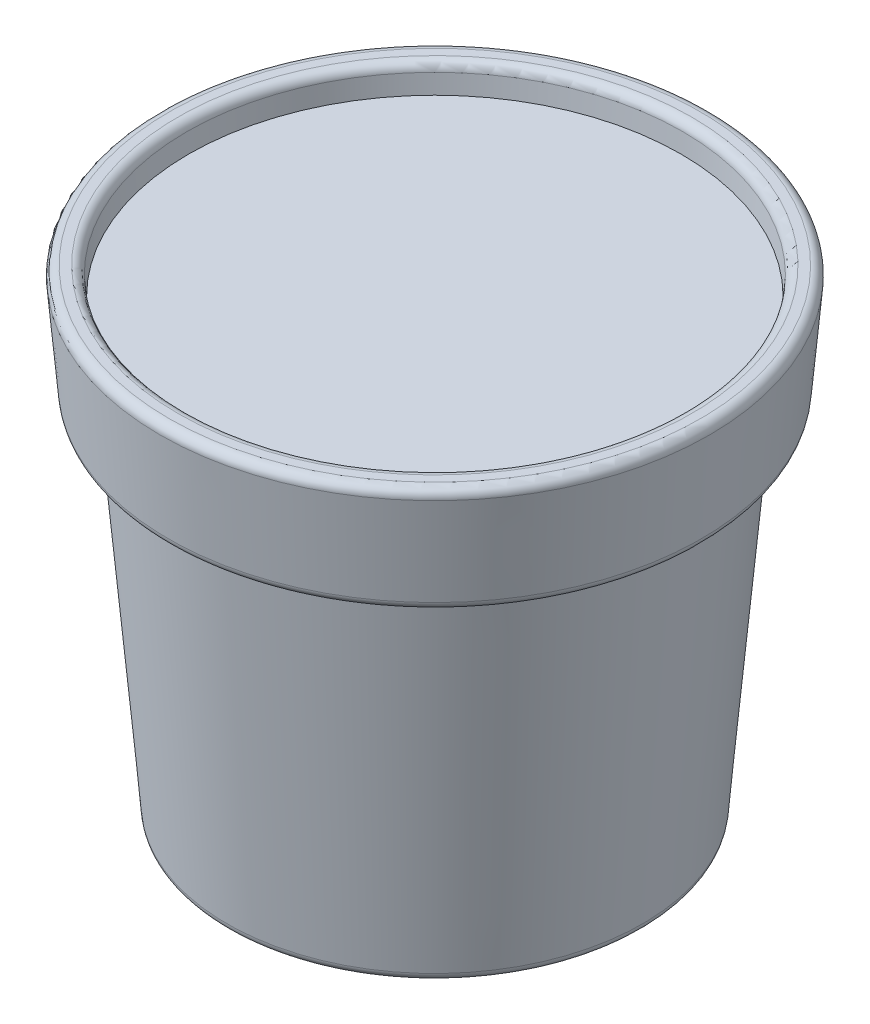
from build123d import *

# Parameters (mm, degrees)
FILLET1_R = 2


with BuildPart() as part:
    # Sketch1 → Revolve1 (revolve)
    with BuildSketch(Plane.XY, mode=Mode.PRIVATE) as revolve1_sk:
        Polygon((0, 0), (0, 100), (55, 100), (55.524931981, 106), (61.524931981, 106), (59.337715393, 81), (53.337715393, 81), (46.251133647, 0), align=None)
    revolve(revolve1_sk.sketch.rotate(Axis((0, 0, 0), (0, 1, 0)), 90), axis=Axis((0, 0, 0), (0, 1, 0)))

    # Fillet1
    fillet1_edges = [part.edges().sort_by_distance(p)[0] for p in [
        (0, 0, 46.251133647),
        (0, 81, 59.337715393),
        (0, 106, 61.524931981),
        (0, 106, 55.524931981),
    ]]
    fillet(fillet1_edges, radius=FILLET1_R)


solid = part.part
